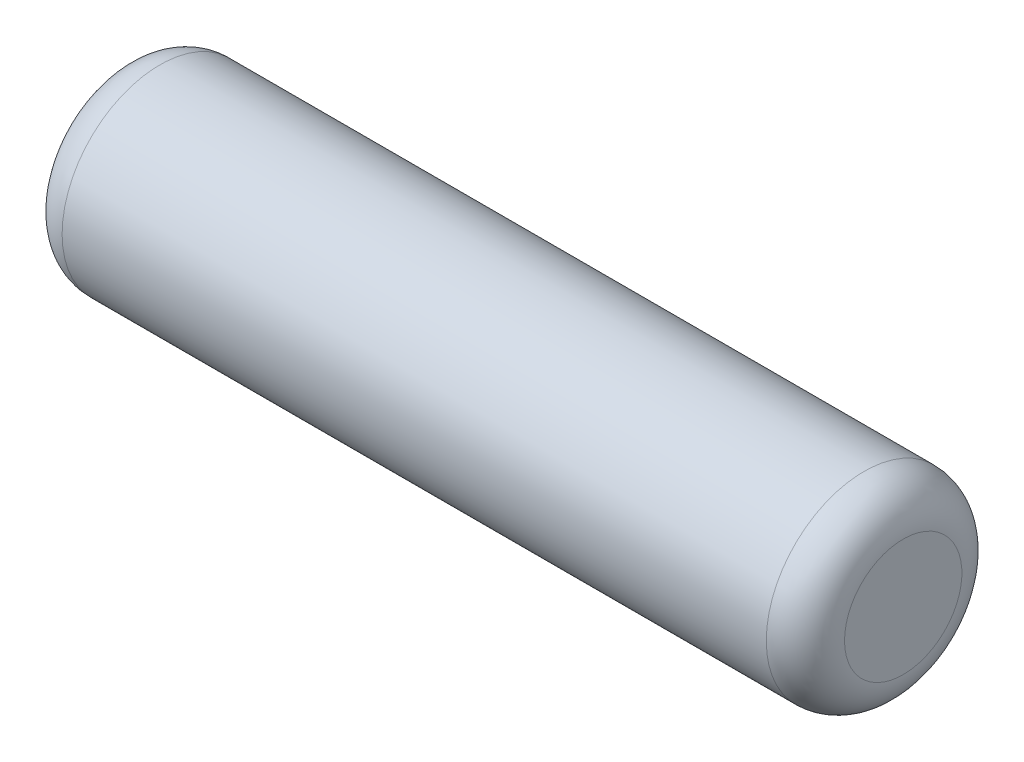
ISO-10303-21;
HEADER;
FILE_DESCRIPTION(('STEP AP214'),'2;1');
FILE_NAME('part.step','',(''),(''),'','','');
FILE_SCHEMA(('AUTOMOTIVE_DESIGN { 1 0 10303 214 1 1 1 1 }'));
ENDSEC;
DATA;
#1=APPLICATION_CONTEXT('core data for automotive mechanical design processes');
#2=APPLICATION_PROTOCOL_DEFINITION('international standard','automotive_design',2000,#1);
#3=PRODUCT_CONTEXT('',#1,'mechanical');
#4=PRODUCT('Part','Part','',(#3));
#5=PRODUCT_RELATED_PRODUCT_CATEGORY('part','',(#4));
#6=PRODUCT_DEFINITION_FORMATION('','',#4);
#7=PRODUCT_DEFINITION_CONTEXT('part definition',#1,'design');
#8=PRODUCT_DEFINITION('design','',#6,#7);
#9=PRODUCT_DEFINITION_SHAPE('','',#8);
#10=(LENGTH_UNIT() NAMED_UNIT(*) SI_UNIT(.MILLI.,.METRE.));
#11=(NAMED_UNIT(*) PLANE_ANGLE_UNIT() SI_UNIT($,.RADIAN.));
#12=(NAMED_UNIT(*) SI_UNIT($,.STERADIAN.) SOLID_ANGLE_UNIT());
#13=UNCERTAINTY_MEASURE_WITH_UNIT(LENGTH_MEASURE(1.E-05),#10,'distance_accuracy_value','');
#14=(GEOMETRIC_REPRESENTATION_CONTEXT(3) GLOBAL_UNCERTAINTY_ASSIGNED_CONTEXT((#13)) GLOBAL_UNIT_ASSIGNED_CONTEXT((#10,
#11,#12)) REPRESENTATION_CONTEXT('',''));
#15=CARTESIAN_POINT('',(0.,0.,0.));
#16=DIRECTION('',(0.,0.,1.));
#17=DIRECTION('',(1.,0.,0.));
#18=AXIS2_PLACEMENT_3D('',#15,#16,#17);
#19=CARTESIAN_POINT('',(0.,0.,0.));
#20=DIRECTION('',(1.,0.,0.));
#21=DIRECTION('',(0.,0.,-1.));
#22=AXIS2_PLACEMENT_3D('',#19,#20,#21);
#23=PLANE('',#22);
#24=CARTESIAN_POINT('',(0.,0.,0.));
#25=DIRECTION('',(1.,0.,0.));
#26=DIRECTION('',(0.,0.,-1.));
#27=AXIS2_PLACEMENT_3D('',#24,#25,#26);
#28=CIRCLE('',#27,3.);
#29=CARTESIAN_POINT('',(0.,0.,-3.));
#30=VERTEX_POINT('',#29);
#31=EDGE_CURVE('E29',#30,#30,#28,.F.);
#32=ORIENTED_EDGE('',*,*,#31,.T.);
#33=EDGE_LOOP('',(#32));
#34=FACE_BOUND('',#33,.T.);
#35=ADVANCED_FACE('F14',(#34),#23,.F.);
#36=CARTESIAN_POINT('',(0.,0.,0.));
#37=DIRECTION('',(-1.,0.,0.));
#38=DIRECTION('',(0.,0.,1.));
#39=AXIS2_PLACEMENT_3D('',#36,#37,#38);
#40=CYLINDRICAL_SURFACE('',#39,5.);
#41=CARTESIAN_POINT('',(2.,0.,0.));
#42=DIRECTION('',(1.,0.,0.));
#43=DIRECTION('',(0.,0.,-1.));
#44=AXIS2_PLACEMENT_3D('',#41,#42,#43);
#45=CIRCLE('',#44,5.);
#46=CARTESIAN_POINT('',(2.,0.,-5.));
#47=VERTEX_POINT('',#46);
#48=EDGE_CURVE('E21',#47,#47,#45,.T.);
#49=ORIENTED_EDGE('',*,*,#48,.T.);
#50=EDGE_LOOP('',(#49));
#51=FACE_BOUND('',#50,.T.);
#52=CARTESIAN_POINT('',(38.,0.,0.));
#53=DIRECTION('',(-1.,0.,0.));
#54=DIRECTION('',(0.,0.,1.));
#55=AXIS2_PLACEMENT_3D('',#52,#53,#54);
#56=CIRCLE('',#55,5.);
#57=CARTESIAN_POINT('',(38.,0.,5.));
#58=VERTEX_POINT('',#57);
#59=EDGE_CURVE('E25',#58,#58,#56,.T.);
#60=ORIENTED_EDGE('',*,*,#59,.T.);
#61=EDGE_LOOP('',(#60));
#62=FACE_BOUND('',#61,.T.);
#63=ADVANCED_FACE('F47',(#51,#62),#40,.T.);
#64=CARTESIAN_POINT('',(40.,5.,0.));
#65=DIRECTION('',(-1.,0.,0.));
#66=DIRECTION('',(0.,0.,1.));
#67=AXIS2_PLACEMENT_3D('',#64,#65,#66);
#68=PLANE('',#67);
#69=CARTESIAN_POINT('',(40.,0.,0.));
#70=DIRECTION('',(-1.,0.,0.));
#71=DIRECTION('',(0.,0.,1.));
#72=AXIS2_PLACEMENT_3D('',#69,#70,#71);
#73=CIRCLE('',#72,3.);
#74=CARTESIAN_POINT('',(40.,0.,3.));
#75=VERTEX_POINT('',#74);
#76=EDGE_CURVE('E9',#75,#75,#73,.F.);
#77=ORIENTED_EDGE('',*,*,#76,.T.);
#78=EDGE_LOOP('',(#77));
#79=FACE_BOUND('',#78,.T.);
#80=ADVANCED_FACE('F38',(#79),#68,.F.);
#81=CARTESIAN_POINT('',(2.,0.,0.));
#82=DIRECTION('',(1.,0.,0.));
#83=DIRECTION('',(0.,0.,-1.));
#84=AXIS2_PLACEMENT_3D('',#81,#82,#83);
#85=TOROIDAL_SURFACE('',#84,3.,2.);
#86=ORIENTED_EDGE('',*,*,#48,.F.);
#87=EDGE_LOOP('',(#86));
#88=FACE_BOUND('',#87,.T.);
#89=ORIENTED_EDGE('',*,*,#31,.F.);
#90=EDGE_LOOP('',(#89));
#91=FACE_BOUND('',#90,.T.);
#92=ADVANCED_FACE('F36',(#88,#91),#85,.T.);
#93=CARTESIAN_POINT('',(38.,0.,0.));
#94=DIRECTION('',(-1.,0.,0.));
#95=DIRECTION('',(0.,0.,1.));
#96=AXIS2_PLACEMENT_3D('',#93,#94,#95);
#97=TOROIDAL_SURFACE('',#96,3.,2.);
#98=ORIENTED_EDGE('',*,*,#76,.F.);
#99=EDGE_LOOP('',(#98));
#100=FACE_BOUND('',#99,.T.);
#101=ORIENTED_EDGE('',*,*,#59,.F.);
#102=EDGE_LOOP('',(#101));
#103=FACE_BOUND('',#102,.T.);
#104=ADVANCED_FACE('F16',(#100,#103),#97,.T.);
#105=CLOSED_SHELL('',(#35,#63,#80,#92,#104));
#106=MANIFOLD_SOLID_BREP('B1',#105);
#107=ADVANCED_BREP_SHAPE_REPRESENTATION('',(#18,#106),#14);
#108=SHAPE_DEFINITION_REPRESENTATION(#9,#107);
ENDSEC;
END-ISO-10303-21;
